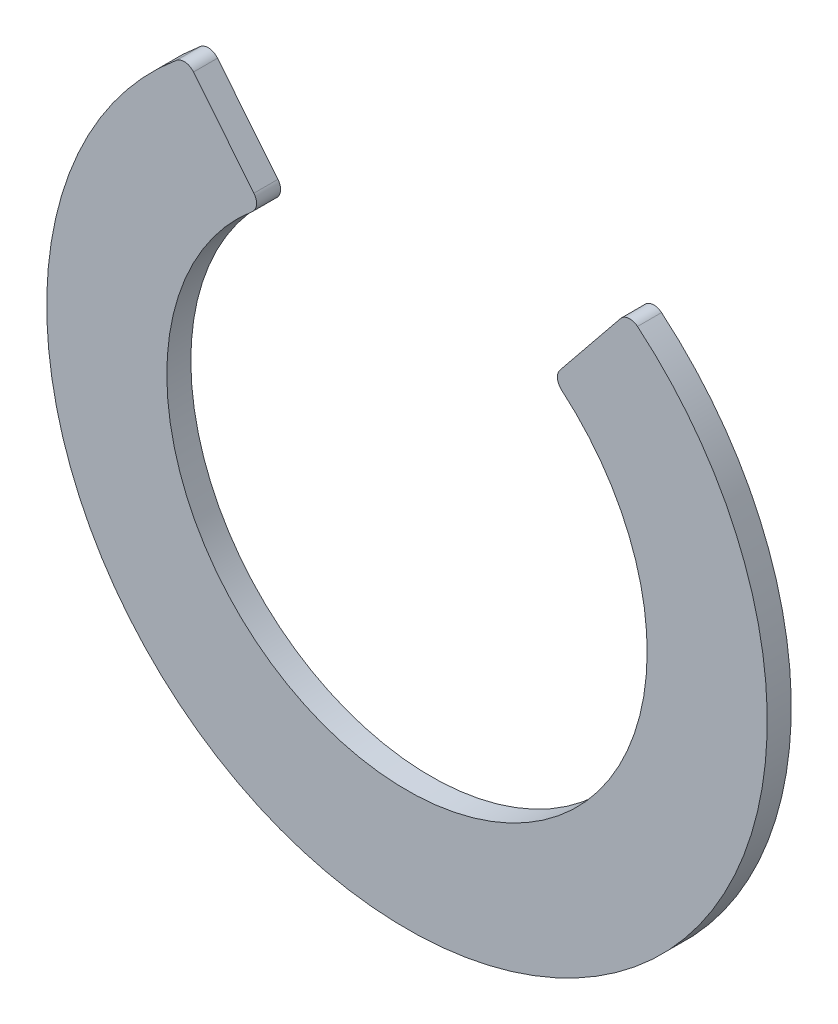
ISO-10303-21;
HEADER;
FILE_DESCRIPTION(('STEP AP214'),'2;1');
FILE_NAME('part.step','',(''),(''),'','','');
FILE_SCHEMA(('AUTOMOTIVE_DESIGN { 1 0 10303 214 1 1 1 1 }'));
ENDSEC;
DATA;
#1=APPLICATION_CONTEXT('core data for automotive mechanical design processes');
#2=APPLICATION_PROTOCOL_DEFINITION('international standard','automotive_design',2000,#1);
#3=PRODUCT_CONTEXT('',#1,'mechanical');
#4=PRODUCT('Part','Part','',(#3));
#5=PRODUCT_RELATED_PRODUCT_CATEGORY('part','',(#4));
#6=PRODUCT_DEFINITION_FORMATION('','',#4);
#7=PRODUCT_DEFINITION_CONTEXT('part definition',#1,'design');
#8=PRODUCT_DEFINITION('design','',#6,#7);
#9=PRODUCT_DEFINITION_SHAPE('','',#8);
#10=(LENGTH_UNIT() NAMED_UNIT(*) SI_UNIT(.MILLI.,.METRE.));
#11=(NAMED_UNIT(*) PLANE_ANGLE_UNIT() SI_UNIT($,.RADIAN.));
#12=(NAMED_UNIT(*) SI_UNIT($,.STERADIAN.) SOLID_ANGLE_UNIT());
#13=UNCERTAINTY_MEASURE_WITH_UNIT(LENGTH_MEASURE(1.E-05),#10,'distance_accuracy_value','');
#14=(GEOMETRIC_REPRESENTATION_CONTEXT(3) GLOBAL_UNCERTAINTY_ASSIGNED_CONTEXT((#13)) GLOBAL_UNIT_ASSIGNED_CONTEXT((#10,
#11,#12)) REPRESENTATION_CONTEXT('',''));
#15=CARTESIAN_POINT('',(0.,0.,0.));
#16=DIRECTION('',(0.,0.,1.));
#17=DIRECTION('',(1.,0.,0.));
#18=AXIS2_PLACEMENT_3D('',#15,#16,#17);
#19=CARTESIAN_POINT('',(-1.35255431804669,1.60642361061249,0.2));
#20=DIRECTION('',(0.,0.,-1.));
#21=DIRECTION('',(-1.,0.,0.));
#22=AXIS2_PLACEMENT_3D('',#19,#20,#21);
#23=CYLINDRICAL_SURFACE('',#22,0.0999999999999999);
#24=CARTESIAN_POINT('',(-1.35255431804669,1.60642361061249,0.));
#25=DIRECTION('',(0.,0.,1.));
#26=DIRECTION('',(1.,0.,0.));
#27=AXIS2_PLACEMENT_3D('',#24,#25,#26);
#28=CIRCLE('',#27,0.0999999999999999);
#29=CARTESIAN_POINT('',(-1.28814696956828,1.52992724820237,0.));
#30=VERTEX_POINT('',#29);
#31=CARTESIAN_POINT('',(-1.27479240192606,1.66929716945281,0.));
#32=VERTEX_POINT('',#31);
#33=EDGE_CURVE('E144',#30,#32,#28,.T.);
#34=ORIENTED_EDGE('',*,*,#33,.T.);
#35=DIRECTION('',(0.,0.,-1.));
#36=VECTOR('',#35,1.);
#37=CARTESIAN_POINT('',(-1.27479240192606,1.66929716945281,0.2));
#38=LINE('',#37,#36);
#39=CARTESIAN_POINT('',(-1.27479240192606,1.66929716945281,0.2));
#40=VERTEX_POINT('',#39);
#41=EDGE_CURVE('E11',#40,#32,#38,.T.);
#42=ORIENTED_EDGE('',*,*,#41,.F.);
#43=CARTESIAN_POINT('',(-1.35255431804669,1.60642361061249,0.2));
#44=DIRECTION('',(0.,0.,1.));
#45=DIRECTION('',(1.,0.,0.));
#46=AXIS2_PLACEMENT_3D('',#43,#44,#45);
#47=CIRCLE('',#46,0.0999999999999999);
#48=CARTESIAN_POINT('',(-1.28814696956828,1.52992724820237,0.2));
#49=VERTEX_POINT('',#48);
#50=EDGE_CURVE('E166',#49,#40,#47,.T.);
#51=ORIENTED_EDGE('',*,*,#50,.F.);
#52=DIRECTION('',(0.,0.,-1.));
#53=VECTOR('',#52,1.);
#54=CARTESIAN_POINT('',(-1.28814696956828,1.52992724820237,0.2));
#55=LINE('',#54,#53);
#56=EDGE_CURVE('E140',#49,#30,#55,.T.);
#57=ORIENTED_EDGE('',*,*,#56,.T.);
#58=EDGE_LOOP('',(#34,#42,#51,#57));
#59=FACE_BOUND('',#58,.T.);
#60=ADVANCED_FACE('F43',(#59),#23,.T.);
#61=CARTESIAN_POINT('',(-1.7778528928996,2.29148157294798,0.2));
#62=DIRECTION('',(-0.777619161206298,-0.628735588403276,0.));
#63=DIRECTION('',(0.628735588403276,-0.777619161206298,0.));
#64=AXIS2_PLACEMENT_3D('',#61,#62,#63);
#65=PLANE('',#64);
#66=DIRECTION('',(-0.628735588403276,0.777619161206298,0.));
#67=VECTOR('',#66,1.);
#68=CARTESIAN_POINT('',(-1.7778528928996,2.29148157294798,0.));
#69=LINE('',#68,#67);
#70=CARTESIAN_POINT('',(-1.7778528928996,2.29148157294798,0.));
#71=VERTEX_POINT('',#70);
#72=EDGE_CURVE('E148',#32,#71,#69,.T.);
#73=ORIENTED_EDGE('',*,*,#72,.T.);
#74=DIRECTION('',(0.,0.,-1.));
#75=VECTOR('',#74,1.);
#76=CARTESIAN_POINT('',(-1.7778528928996,2.29148157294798,0.2));
#77=LINE('',#76,#75);
#78=CARTESIAN_POINT('',(-1.7778528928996,2.29148157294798,0.2));
#79=VERTEX_POINT('',#78);
#80=EDGE_CURVE('E52',#79,#71,#77,.T.);
#81=ORIENTED_EDGE('',*,*,#80,.F.);
#82=DIRECTION('',(-0.628735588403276,0.777619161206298,0.));
#83=VECTOR('',#82,1.);
#84=CARTESIAN_POINT('',(-1.7778528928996,2.29148157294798,0.2));
#85=LINE('',#84,#83);
#86=EDGE_CURVE('E103',#40,#79,#85,.T.);
#87=ORIENTED_EDGE('',*,*,#86,.F.);
#88=ORIENTED_EDGE('',*,*,#41,.T.);
#89=EDGE_LOOP('',(#73,#81,#87,#88));
#90=FACE_BOUND('',#89,.T.);
#91=ADVANCED_FACE('F212',(#90),#65,.F.);
#92=CARTESIAN_POINT('',(-1.85561480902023,2.22860801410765,0.2));
#93=DIRECTION('',(0.,0.,-1.));
#94=DIRECTION('',(-1.,0.,0.));
#95=AXIS2_PLACEMENT_3D('',#92,#93,#94);
#96=CYLINDRICAL_SURFACE('',#95,0.0999999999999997);
#97=CARTESIAN_POINT('',(-1.85561480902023,2.22860801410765,0.));
#98=DIRECTION('',(0.,0.,1.));
#99=DIRECTION('',(-1.,0.,0.));
#100=AXIS2_PLACEMENT_3D('',#97,#98,#99);
#101=CIRCLE('',#100,0.0999999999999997);
#102=CARTESIAN_POINT('',(-1.91960152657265,2.30545656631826,0.));
#103=VERTEX_POINT('',#102);
#104=EDGE_CURVE('E151',#71,#103,#101,.T.);
#105=ORIENTED_EDGE('',*,*,#104,.T.);
#106=DIRECTION('',(0.,0.,-1.));
#107=VECTOR('',#106,1.);
#108=CARTESIAN_POINT('',(-1.91960152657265,2.30545656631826,0.2));
#109=LINE('',#108,#107);
#110=CARTESIAN_POINT('',(-1.91960152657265,2.30545656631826,0.2));
#111=VERTEX_POINT('',#110);
#112=EDGE_CURVE('E177',#111,#103,#109,.T.);
#113=ORIENTED_EDGE('',*,*,#112,.F.);
#114=CARTESIAN_POINT('',(-1.85561480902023,2.22860801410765,0.2));
#115=DIRECTION('',(0.,0.,1.));
#116=DIRECTION('',(-1.,0.,0.));
#117=AXIS2_PLACEMENT_3D('',#114,#115,#116);
#118=CIRCLE('',#117,0.0999999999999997);
#119=EDGE_CURVE('E187',#79,#111,#118,.T.);
#120=ORIENTED_EDGE('',*,*,#119,.F.);
#121=ORIENTED_EDGE('',*,*,#80,.T.);
#122=EDGE_LOOP('',(#105,#113,#120,#121));
#123=FACE_BOUND('',#122,.T.);
#124=ADVANCED_FACE('F185',(#123),#96,.T.);
#125=CARTESIAN_POINT('',(0.,0.,0.2));
#126=DIRECTION('',(0.,0.,-1.));
#127=DIRECTION('',(-1.,0.,0.));
#128=AXIS2_PLACEMENT_3D('',#125,#126,#127);
#129=CYLINDRICAL_SURFACE('',#128,3.);
#130=CARTESIAN_POINT('',(0.,0.,0.));
#131=DIRECTION('',(0.,0.,1.));
#132=DIRECTION('',(-1.,0.,0.));
#133=AXIS2_PLACEMENT_3D('',#130,#131,#132);
#134=CIRCLE('',#133,3.);
#135=CARTESIAN_POINT('',(1.91960152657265,2.30545656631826,0.));
#136=VERTEX_POINT('',#135);
#137=EDGE_CURVE('E154',#103,#136,#134,.T.);
#138=ORIENTED_EDGE('',*,*,#137,.T.);
#139=DIRECTION('',(0.,0.,-1.));
#140=VECTOR('',#139,1.);
#141=CARTESIAN_POINT('',(1.91960152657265,2.30545656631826,0.2));
#142=LINE('',#141,#140);
#143=CARTESIAN_POINT('',(1.91960152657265,2.30545656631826,0.2));
#144=VERTEX_POINT('',#143);
#145=EDGE_CURVE('E173',#144,#136,#142,.T.);
#146=ORIENTED_EDGE('',*,*,#145,.F.);
#147=CARTESIAN_POINT('',(0.,0.,0.2));
#148=DIRECTION('',(0.,0.,1.));
#149=DIRECTION('',(-1.,0.,0.));
#150=AXIS2_PLACEMENT_3D('',#147,#148,#149);
#151=CIRCLE('',#150,3.);
#152=EDGE_CURVE('E200',#111,#144,#151,.T.);
#153=ORIENTED_EDGE('',*,*,#152,.F.);
#154=ORIENTED_EDGE('',*,*,#112,.T.);
#155=EDGE_LOOP('',(#138,#146,#153,#154));
#156=FACE_BOUND('',#155,.T.);
#157=ADVANCED_FACE('F195',(#156),#129,.T.);
#158=CARTESIAN_POINT('',(1.85561480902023,2.22860801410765,0.2));
#159=DIRECTION('',(0.,0.,-1.));
#160=DIRECTION('',(-1.,0.,0.));
#161=AXIS2_PLACEMENT_3D('',#158,#159,#160);
#162=CYLINDRICAL_SURFACE('',#161,0.1);
#163=CARTESIAN_POINT('',(1.85561480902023,2.22860801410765,0.));
#164=DIRECTION('',(0.,0.,1.));
#165=DIRECTION('',(1.,0.,0.));
#166=AXIS2_PLACEMENT_3D('',#163,#164,#165);
#167=CIRCLE('',#166,0.1);
#168=CARTESIAN_POINT('',(1.7778528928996,2.29148157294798,0.));
#169=VERTEX_POINT('',#168);
#170=EDGE_CURVE('E157',#136,#169,#167,.T.);
#171=ORIENTED_EDGE('',*,*,#170,.T.);
#172=DIRECTION('',(0.,0.,-1.));
#173=VECTOR('',#172,1.);
#174=CARTESIAN_POINT('',(1.7778528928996,2.29148157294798,0.2));
#175=LINE('',#174,#173);
#176=CARTESIAN_POINT('',(1.7778528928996,2.29148157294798,0.2));
#177=VERTEX_POINT('',#176);
#178=EDGE_CURVE('E133',#177,#169,#175,.T.);
#179=ORIENTED_EDGE('',*,*,#178,.F.);
#180=CARTESIAN_POINT('',(1.85561480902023,2.22860801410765,0.2));
#181=DIRECTION('',(0.,0.,1.));
#182=DIRECTION('',(1.,0.,0.));
#183=AXIS2_PLACEMENT_3D('',#180,#181,#182);
#184=CIRCLE('',#183,0.1);
#185=EDGE_CURVE('E122',#144,#177,#184,.T.);
#186=ORIENTED_EDGE('',*,*,#185,.F.);
#187=ORIENTED_EDGE('',*,*,#145,.T.);
#188=EDGE_LOOP('',(#171,#179,#186,#187));
#189=FACE_BOUND('',#188,.T.);
#190=ADVANCED_FACE('F198',(#189),#162,.T.);
#191=CARTESIAN_POINT('',(1.27479240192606,1.66929716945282,0.2));
#192=DIRECTION('',(0.777619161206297,-0.628735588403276,0.));
#193=DIRECTION('',(0.628735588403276,0.777619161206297,0.));
#194=AXIS2_PLACEMENT_3D('',#191,#192,#193);
#195=PLANE('',#194);
#196=DIRECTION('',(-0.628735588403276,-0.777619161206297,0.));
#197=VECTOR('',#196,1.);
#198=CARTESIAN_POINT('',(1.27479240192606,1.66929716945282,0.));
#199=LINE('',#198,#197);
#200=CARTESIAN_POINT('',(1.27479240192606,1.66929716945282,0.));
#201=VERTEX_POINT('',#200);
#202=EDGE_CURVE('E131',#169,#201,#199,.T.);
#203=ORIENTED_EDGE('',*,*,#202,.T.);
#204=DIRECTION('',(0.,0.,-1.));
#205=VECTOR('',#204,1.);
#206=CARTESIAN_POINT('',(1.27479240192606,1.66929716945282,0.2));
#207=LINE('',#206,#205);
#208=CARTESIAN_POINT('',(1.27479240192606,1.66929716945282,0.2));
#209=VERTEX_POINT('',#208);
#210=EDGE_CURVE('E128',#209,#201,#207,.T.);
#211=ORIENTED_EDGE('',*,*,#210,.F.);
#212=DIRECTION('',(-0.628735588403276,-0.777619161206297,0.));
#213=VECTOR('',#212,1.);
#214=CARTESIAN_POINT('',(1.27479240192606,1.66929716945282,0.2));
#215=LINE('',#214,#213);
#216=EDGE_CURVE('E116',#177,#209,#215,.T.);
#217=ORIENTED_EDGE('',*,*,#216,.F.);
#218=ORIENTED_EDGE('',*,*,#178,.T.);
#219=EDGE_LOOP('',(#203,#211,#217,#218));
#220=FACE_BOUND('',#219,.T.);
#221=ADVANCED_FACE('F129',(#220),#195,.F.);
#222=CARTESIAN_POINT('',(1.35255431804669,1.60642361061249,0.2));
#223=DIRECTION('',(0.,0.,-1.));
#224=DIRECTION('',(-1.,0.,0.));
#225=AXIS2_PLACEMENT_3D('',#222,#223,#224);
#226=CYLINDRICAL_SURFACE('',#225,0.1);
#227=CARTESIAN_POINT('',(1.35255431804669,1.60642361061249,0.));
#228=DIRECTION('',(0.,0.,1.));
#229=DIRECTION('',(-1.,0.,0.));
#230=AXIS2_PLACEMENT_3D('',#227,#228,#229);
#231=CIRCLE('',#230,0.1);
#232=CARTESIAN_POINT('',(1.28814696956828,1.52992724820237,0.));
#233=VERTEX_POINT('',#232);
#234=EDGE_CURVE('E89',#201,#233,#231,.T.);
#235=ORIENTED_EDGE('',*,*,#234,.T.);
#236=DIRECTION('',(0.,0.,-1.));
#237=VECTOR('',#236,1.);
#238=CARTESIAN_POINT('',(1.28814696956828,1.52992724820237,0.2));
#239=LINE('',#238,#237);
#240=CARTESIAN_POINT('',(1.28814696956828,1.52992724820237,0.2));
#241=VERTEX_POINT('',#240);
#242=EDGE_CURVE('E134',#241,#233,#239,.T.);
#243=ORIENTED_EDGE('',*,*,#242,.F.);
#244=CARTESIAN_POINT('',(1.35255431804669,1.60642361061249,0.2));
#245=DIRECTION('',(0.,0.,1.));
#246=DIRECTION('',(-1.,0.,0.));
#247=AXIS2_PLACEMENT_3D('',#244,#245,#246);
#248=CIRCLE('',#247,0.1);
#249=EDGE_CURVE('E120',#209,#241,#248,.T.);
#250=ORIENTED_EDGE('',*,*,#249,.F.);
#251=ORIENTED_EDGE('',*,*,#210,.T.);
#252=EDGE_LOOP('',(#235,#243,#250,#251));
#253=FACE_BOUND('',#252,.T.);
#254=ADVANCED_FACE('F136',(#253),#226,.T.);
#255=CARTESIAN_POINT('',(0.,0.,0.2));
#256=DIRECTION('',(0.,0.,-1.));
#257=DIRECTION('',(-1.,0.,0.));
#258=AXIS2_PLACEMENT_3D('',#255,#256,#257);
#259=CYLINDRICAL_SURFACE('',#258,2.);
#260=CARTESIAN_POINT('',(0.,0.,0.));
#261=DIRECTION('',(0.,0.,-1.));
#262=DIRECTION('',(-1.,0.,0.));
#263=AXIS2_PLACEMENT_3D('',#260,#261,#262);
#264=CIRCLE('',#263,2.);
#265=EDGE_CURVE('E95',#233,#30,#264,.T.);
#266=ORIENTED_EDGE('',*,*,#265,.T.);
#267=ORIENTED_EDGE('',*,*,#56,.F.);
#268=CARTESIAN_POINT('',(0.,0.,0.2));
#269=DIRECTION('',(0.,0.,-1.));
#270=DIRECTION('',(-1.,0.,0.));
#271=AXIS2_PLACEMENT_3D('',#268,#269,#270);
#272=CIRCLE('',#271,2.);
#273=EDGE_CURVE('E60',#241,#49,#272,.T.);
#274=ORIENTED_EDGE('',*,*,#273,.F.);
#275=ORIENTED_EDGE('',*,*,#242,.T.);
#276=EDGE_LOOP('',(#266,#267,#274,#275));
#277=FACE_BOUND('',#276,.T.);
#278=ADVANCED_FACE('F228',(#277),#259,.F.);
#279=CARTESIAN_POINT('',(-1.35255431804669,1.60642361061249,0.2));
#280=DIRECTION('',(0.,0.,1.));
#281=DIRECTION('',(1.,0.,0.));
#282=AXIS2_PLACEMENT_3D('',#279,#280,#281);
#283=PLANE('',#282);
#284=ORIENTED_EDGE('',*,*,#50,.T.);
#285=ORIENTED_EDGE('',*,*,#86,.T.);
#286=ORIENTED_EDGE('',*,*,#119,.T.);
#287=ORIENTED_EDGE('',*,*,#152,.T.);
#288=ORIENTED_EDGE('',*,*,#185,.T.);
#289=ORIENTED_EDGE('',*,*,#216,.T.);
#290=ORIENTED_EDGE('',*,*,#249,.T.);
#291=ORIENTED_EDGE('',*,*,#273,.T.);
#292=EDGE_LOOP('',(#284,#285,#286,#287,#288,#289,#290,#291));
#293=FACE_BOUND('',#292,.T.);
#294=ADVANCED_FACE('F118',(#293),#283,.T.);
#295=CARTESIAN_POINT('',(-1.35255431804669,1.60642361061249,0.));
#296=DIRECTION('',(0.,0.,1.));
#297=DIRECTION('',(1.,0.,0.));
#298=AXIS2_PLACEMENT_3D('',#295,#296,#297);
#299=PLANE('',#298);
#300=ORIENTED_EDGE('',*,*,#33,.F.);
#301=ORIENTED_EDGE('',*,*,#265,.F.);
#302=ORIENTED_EDGE('',*,*,#234,.F.);
#303=ORIENTED_EDGE('',*,*,#202,.F.);
#304=ORIENTED_EDGE('',*,*,#170,.F.);
#305=ORIENTED_EDGE('',*,*,#137,.F.);
#306=ORIENTED_EDGE('',*,*,#104,.F.);
#307=ORIENTED_EDGE('',*,*,#72,.F.);
#308=EDGE_LOOP('',(#300,#301,#302,#303,#304,#305,#306,#307));
#309=FACE_BOUND('',#308,.T.);
#310=ADVANCED_FACE('F191',(#309),#299,.F.);
#311=CLOSED_SHELL('',(#60,#91,#124,#157,#190,#221,#254,#278,#294,#310));
#312=MANIFOLD_SOLID_BREP('B2',#311);
#313=ADVANCED_BREP_SHAPE_REPRESENTATION('',(#18,#312),#14);
#314=SHAPE_DEFINITION_REPRESENTATION(#9,#313);
ENDSEC;
END-ISO-10303-21;
